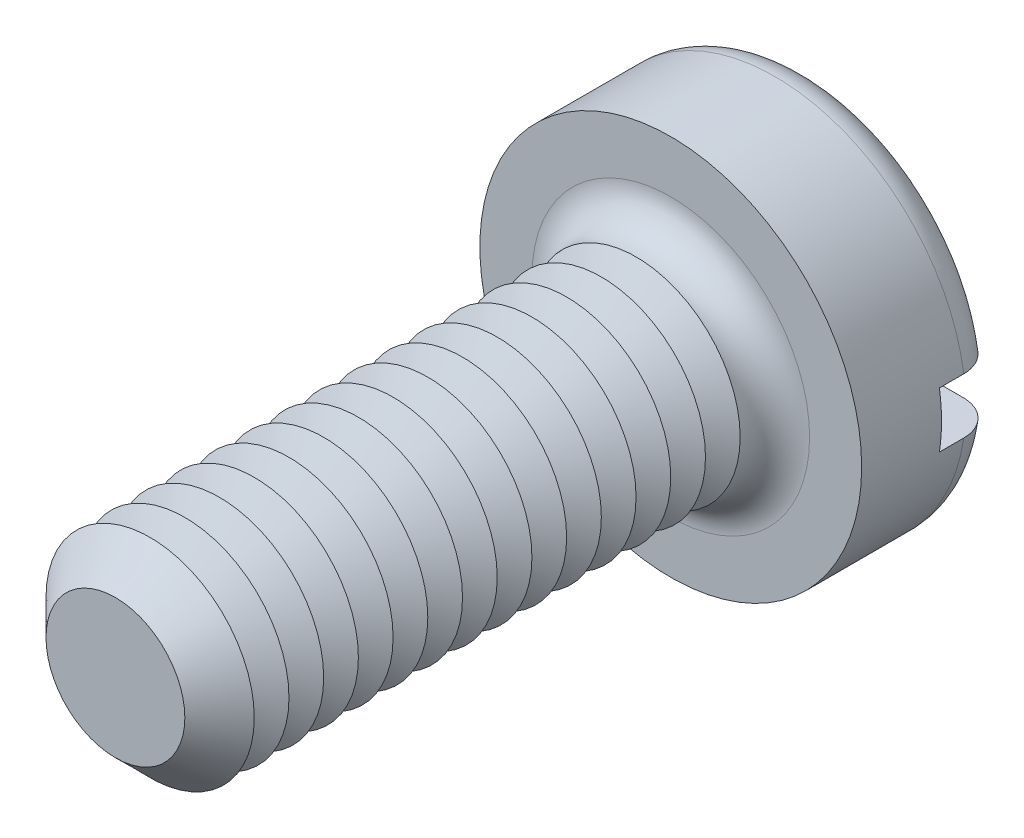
from build123d import *

# Parameters (mm, degrees)
SKETCH3_R           = 2.75
BOSS_EXTRUDE2_DEPTH = 2
SKETCH4_R           = 1.5
BOSS_EXTRUDE3_DEPTH = 8
FILLET1_R           = 0.5
CHAMFER1_SIZE       = 0.5
LPATTERN1_COUNT     = 14
LPATTERN1_PITCH     = 0.5
SKETCH8_W           = 5.5
SKETCH8_H           = 0.8
CUT_EXTRUDE1_DEPTH  = 0.85


with BuildPart() as part:
    # Sketch3 → Boss-Extrude2 (new body)
    with BuildSketch(Plane.XY):
        Circle(SKETCH3_R)
    extrude(amount=-BOSS_EXTRUDE2_DEPTH)

    # Sketch4 → Boss-Extrude3 (add)
    with BuildSketch(Plane.XY):
        Circle(SKETCH4_R)
    extrude(amount=BOSS_EXTRUDE3_DEPTH)

    # Fillet1
    fillet1_edges = [part.edges().sort_by_distance(p)[0] for p in [
        (-2.75, 0, -2),
        (-1.5, 0, 0),
    ]]
    fillet(fillet1_edges, radius=FILLET1_R)

    # Chamfer1
    chamfer1_edges = [part.edges().sort_by_distance(p)[0] for p in [
        (-1.5, 0, 8),
    ]]
    chamfer(chamfer1_edges, length=CHAMFER1_SIZE)

    # Sketch6 → Cut-Revolve1 (revolve, cut)
    with BuildSketch(Plane(origin=(0, 0, 0), x_dir=(0, 0, -1), z_dir=(1, 0, 0)), mode=Mode.PRIVATE) as cut_revolve1_sk:
        Polygon((-0.5, 1.5), (-0.75, 1.066987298), (-1, 1.5), align=None)
    cut_revolve1 = revolve(cut_revolve1_sk.sketch.rotate(Axis((0, 0, -1.694361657), (0, 0, 1)), 90), axis=Axis((0, 0, -1.694361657), (0, 0, 1)), mode=Mode.SUBTRACT)

    # LPattern1: Cut-Revolve1 ×14
    with Locations(*[(0, 0, i * LPATTERN1_PITCH) for i in range(1, LPATTERN1_COUNT)]):
        add(cut_revolve1, mode=Mode.SUBTRACT)

    # Sketch8 → Cut-Extrude1 (cut)
    with BuildSketch(Plane(origin=(0, 0, -2), x_dir=(-1, 0, 0), z_dir=(0, 0, -1))):
        Rectangle(SKETCH8_W, SKETCH8_H)
    extrude(amount=-CUT_EXTRUDE1_DEPTH, mode=Mode.SUBTRACT)


solid = part.part
